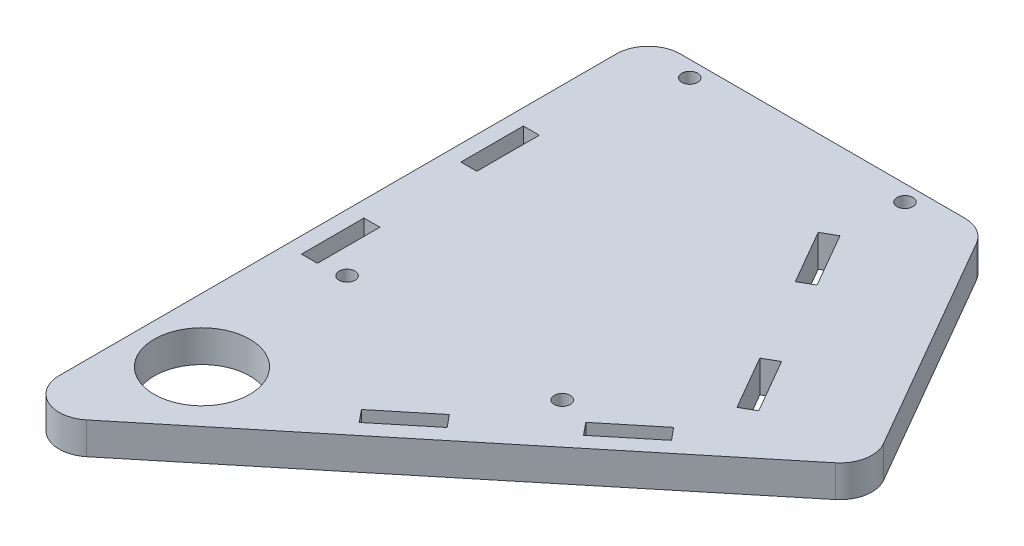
from build123d import *

# Parameters (mm, degrees)
SKETCH1_R      = 1.5875
SKETCH1_R_2    = 9.525
SKETCH1_W      = 3.175
SKETCH1_H      = 12.446
EXTRUDE1_DEPTH = 6.35


with BuildPart() as part:
    # Sketch1 → Extrude1 (new body)
    with BuildSketch(Plane(origin=(0, 0, 0), x_dir=(1, 0, 0), z_dir=(0, 1, 0))):
        with BuildLine():
            Line((-130.626546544, 191.889171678), (-142.024806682, 182.547302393))
            ThreePointArc((-142.024806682, 182.547302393), (-148.766847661, 181.719100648), (-152.4, 187.458546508))
            Line((-152.4, 187.458546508), (-152.4, 298.45))
            ThreePointArc((-152.4, 298.45), (-150.540128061, 302.940128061), (-146.05, 304.8))
            Line((-146.05, 304.8), (-89.36603146, 304.8))
            ThreePointArc((-89.36603146, 304.8), (-86.19103146, 303.949261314), (-83.866770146, 301.625))
            Line((-83.866770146, 301.625), (-58.575569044, 257.819354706))
            ThreePointArc((-58.575569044, 257.819354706), (-57.827779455, 253.505559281), (-60.04963704, 249.733110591))
            Line((-60.04963704, 249.733110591), (-130.626546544, 191.889171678))
        make_face()
        with Locations(Location((-140.97, 301.625, 0), (0, 0, 270))):
            Circle(SKETCH1_R, mode=Mode.SUBTRACT)
        with Locations(Location((-140.97, 233.3625, 0), (0, 0, 270))):
            Circle(SKETCH1_R, mode=Mode.SUBTRACT)
        with Locations(Location((-98.1075, 301.625, 0), (0, 0, 270))):
            Circle(SKETCH1_R, mode=Mode.SUBTRACT)
        with Locations(Location((-98.1075, 233.3625, 0), (0, 0, 270))):
            Circle(SKETCH1_R, mode=Mode.SUBTRACT)
        with Locations(Location((-139.7, 203.2, 0), (0, 0, 270))):
            Circle(SKETCH1_R_2, mode=Mode.SUBTRACT)
        with Locations((-147.6375, 270.519354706)):
            Rectangle(SKETCH1_W, SKETCH1_H, mode=Mode.SUBTRACT)
        with Locations((-147.6375, 238.769354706)):
            Rectangle(SKETCH1_W, SKETCH1_H, mode=Mode.SUBTRACT)
        Polygon((-101.517584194, 287.747106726), (-98.767953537, 289.334606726), (-92.544953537, 278.55605455), (-95.294584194, 276.96855455), align=None, mode=Mode.SUBTRACT)
        Polygon((-76.669953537, 251.05974798), (-82.892953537, 261.838300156), (-85.642584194, 260.250800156), (-79.419584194, 249.47224798), align=None, mode=Mode.SUBTRACT)
        Polygon((-82.272155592, 239.730057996), (-80.259558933, 237.274435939), (-89.885597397, 229.385057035), (-91.898194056, 231.840679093), align=None, mode=Mode.SUBTRACT)
        Polygon((-114.44181797, 209.259090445), (-104.815779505, 217.148469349), (-106.828376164, 219.604091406), (-116.454414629, 211.714712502), align=None, mode=Mode.SUBTRACT)
    extrude(amount=EXTRUDE1_DEPTH)


solid = part.part
